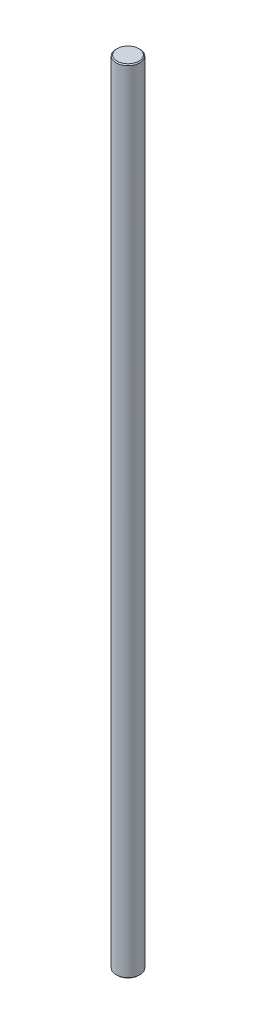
ISO-10303-21;
HEADER;
FILE_DESCRIPTION(('STEP AP214'),'2;1');
FILE_NAME('part.step','',(''),(''),'','','');
FILE_SCHEMA(('AUTOMOTIVE_DESIGN { 1 0 10303 214 1 1 1 1 }'));
ENDSEC;
DATA;
#1=APPLICATION_CONTEXT('core data for automotive mechanical design processes');
#2=APPLICATION_PROTOCOL_DEFINITION('international standard','automotive_design',2000,#1);
#3=PRODUCT_CONTEXT('',#1,'mechanical');
#4=PRODUCT('Part','Part','',(#3));
#5=PRODUCT_RELATED_PRODUCT_CATEGORY('part','',(#4));
#6=PRODUCT_DEFINITION_FORMATION('','',#4);
#7=PRODUCT_DEFINITION_CONTEXT('part definition',#1,'design');
#8=PRODUCT_DEFINITION('design','',#6,#7);
#9=PRODUCT_DEFINITION_SHAPE('','',#8);
#10=(LENGTH_UNIT() NAMED_UNIT(*) SI_UNIT(.MILLI.,.METRE.));
#11=(NAMED_UNIT(*) PLANE_ANGLE_UNIT() SI_UNIT($,.RADIAN.));
#12=(NAMED_UNIT(*) SI_UNIT($,.STERADIAN.) SOLID_ANGLE_UNIT());
#13=UNCERTAINTY_MEASURE_WITH_UNIT(LENGTH_MEASURE(1.E-05),#10,'distance_accuracy_value','');
#14=(GEOMETRIC_REPRESENTATION_CONTEXT(3) GLOBAL_UNCERTAINTY_ASSIGNED_CONTEXT((#13)) GLOBAL_UNIT_ASSIGNED_CONTEXT((#10,
#11,#12)) REPRESENTATION_CONTEXT('',''));
#15=CARTESIAN_POINT('',(0.,0.,0.));
#16=DIRECTION('',(0.,0.,1.));
#17=DIRECTION('',(1.,0.,0.));
#18=AXIS2_PLACEMENT_3D('',#15,#16,#17);
#19=CARTESIAN_POINT('',(0.,0.,0.));
#20=DIRECTION('',(0.,1.,0.));
#21=DIRECTION('',(0.,0.,1.));
#22=AXIS2_PLACEMENT_3D('',#19,#20,#21);
#23=CYLINDRICAL_SURFACE('',#22,5.99999999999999);
#24=CARTESIAN_POINT('',(0.,0.499999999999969,0.));
#25=DIRECTION('',(0.,-1.,0.));
#26=DIRECTION('',(0.,0.,-1.));
#27=AXIS2_PLACEMENT_3D('',#24,#25,#26);
#28=CIRCLE('',#27,5.99999999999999);
#29=CARTESIAN_POINT('',(0.,0.499999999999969,-5.99999999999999));
#30=VERTEX_POINT('',#29);
#31=EDGE_CURVE('E41',#30,#30,#28,.F.);
#32=ORIENTED_EDGE('',*,*,#31,.T.);
#33=EDGE_LOOP('',(#32));
#34=FACE_BOUND('',#33,.T.);
#35=CARTESIAN_POINT('',(0.,399.5,0.));
#36=DIRECTION('',(0.,1.,0.));
#37=DIRECTION('',(0.,0.,1.));
#38=AXIS2_PLACEMENT_3D('',#35,#36,#37);
#39=CIRCLE('',#38,5.99999999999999);
#40=CARTESIAN_POINT('',(0.,399.5,5.99999999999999));
#41=VERTEX_POINT('',#40);
#42=EDGE_CURVE('E45',#41,#41,#39,.F.);
#43=ORIENTED_EDGE('',*,*,#42,.T.);
#44=EDGE_LOOP('',(#43));
#45=FACE_BOUND('',#44,.T.);
#46=ADVANCED_FACE('F30',(#34,#45),#23,.T.);
#47=CARTESIAN_POINT('',(-6.,0.,0.));
#48=DIRECTION('',(0.,-1.,0.));
#49=DIRECTION('',(0.,0.,-1.));
#50=AXIS2_PLACEMENT_3D('',#47,#48,#49);
#51=PLANE('',#50);
#52=CARTESIAN_POINT('',(0.,0.,0.));
#53=DIRECTION('',(0.,-1.,0.));
#54=DIRECTION('',(0.,0.,-1.));
#55=AXIS2_PLACEMENT_3D('',#52,#53,#54);
#56=CIRCLE('',#55,5.50000000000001);
#57=CARTESIAN_POINT('',(0.,0.,-5.50000000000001));
#58=VERTEX_POINT('',#57);
#59=EDGE_CURVE('E37',#58,#58,#56,.T.);
#60=ORIENTED_EDGE('',*,*,#59,.T.);
#61=EDGE_LOOP('',(#60));
#62=FACE_BOUND('',#61,.T.);
#63=ADVANCED_FACE('F61',(#62),#51,.T.);
#64=CARTESIAN_POINT('',(0.,400.,0.));
#65=DIRECTION('',(0.,1.,0.));
#66=DIRECTION('',(0.,0.,1.));
#67=AXIS2_PLACEMENT_3D('',#64,#65,#66);
#68=PLANE('',#67);
#69=CARTESIAN_POINT('',(0.,400.,0.));
#70=DIRECTION('',(0.,1.,0.));
#71=DIRECTION('',(0.,0.,1.));
#72=AXIS2_PLACEMENT_3D('',#69,#70,#71);
#73=CIRCLE('',#72,5.50000000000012);
#74=CARTESIAN_POINT('',(0.,400.,5.50000000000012));
#75=VERTEX_POINT('',#74);
#76=EDGE_CURVE('E10',#75,#75,#73,.T.);
#77=ORIENTED_EDGE('',*,*,#76,.T.);
#78=EDGE_LOOP('',(#77));
#79=FACE_BOUND('',#78,.T.);
#80=ADVANCED_FACE('F58',(#79),#68,.T.);
#81=CARTESIAN_POINT('',(0.,0.499999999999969,0.));
#82=DIRECTION('',(0.,1.,0.));
#83=DIRECTION('',(0.,0.,1.));
#84=AXIS2_PLACEMENT_3D('',#81,#82,#83);
#85=CONICAL_SURFACE('',#84,5.99999999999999,0.785398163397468);
#86=ORIENTED_EDGE('',*,*,#59,.F.);
#87=EDGE_LOOP('',(#86));
#88=FACE_BOUND('',#87,.T.);
#89=ORIENTED_EDGE('',*,*,#31,.F.);
#90=EDGE_LOOP('',(#89));
#91=FACE_BOUND('',#90,.T.);
#92=ADVANCED_FACE('F54',(#88,#91),#85,.T.);
#93=CARTESIAN_POINT('',(0.,400.,0.));
#94=DIRECTION('',(0.,-1.,0.));
#95=DIRECTION('',(0.,0.,-1.));
#96=AXIS2_PLACEMENT_3D('',#93,#94,#95);
#97=CONICAL_SURFACE('',#96,5.50000000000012,0.785398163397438);
#98=ORIENTED_EDGE('',*,*,#42,.F.);
#99=EDGE_LOOP('',(#98));
#100=FACE_BOUND('',#99,.T.);
#101=ORIENTED_EDGE('',*,*,#76,.F.);
#102=EDGE_LOOP('',(#101));
#103=FACE_BOUND('',#102,.T.);
#104=ADVANCED_FACE('F32',(#100,#103),#97,.T.);
#105=CLOSED_SHELL('',(#46,#63,#80,#92,#104));
#106=MANIFOLD_SOLID_BREP('B2',#105);
#107=ADVANCED_BREP_SHAPE_REPRESENTATION('',(#18,#106),#14);
#108=SHAPE_DEFINITION_REPRESENTATION(#9,#107);
ENDSEC;
END-ISO-10303-21;
